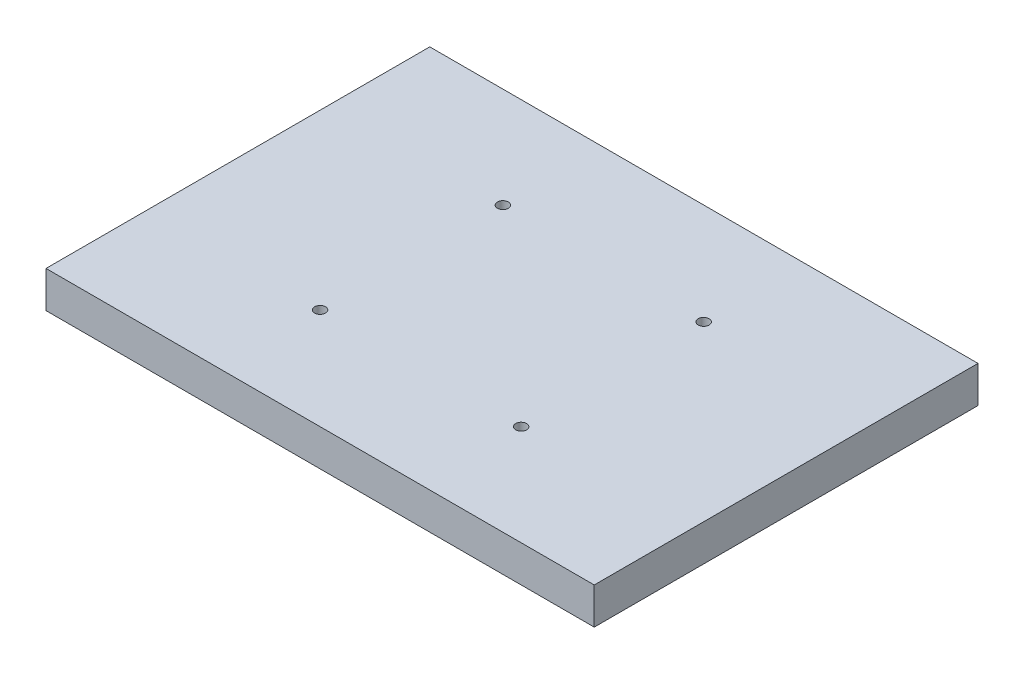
ISO-10303-21;
HEADER;
FILE_DESCRIPTION(('STEP AP214'),'2;1');
FILE_NAME('part.step','',(''),(''),'','','');
FILE_SCHEMA(('AUTOMOTIVE_DESIGN { 1 0 10303 214 1 1 1 1 }'));
ENDSEC;
DATA;
#1=APPLICATION_CONTEXT('core data for automotive mechanical design processes');
#2=APPLICATION_PROTOCOL_DEFINITION('international standard','automotive_design',2000,#1);
#3=PRODUCT_CONTEXT('',#1,'mechanical');
#4=PRODUCT('Part','Part','',(#3));
#5=PRODUCT_RELATED_PRODUCT_CATEGORY('part','',(#4));
#6=PRODUCT_DEFINITION_FORMATION('','',#4);
#7=PRODUCT_DEFINITION_CONTEXT('part definition',#1,'design');
#8=PRODUCT_DEFINITION('design','',#6,#7);
#9=PRODUCT_DEFINITION_SHAPE('','',#8);
#10=(LENGTH_UNIT() NAMED_UNIT(*) SI_UNIT(.MILLI.,.METRE.));
#11=(NAMED_UNIT(*) PLANE_ANGLE_UNIT() SI_UNIT($,.RADIAN.));
#12=(NAMED_UNIT(*) SI_UNIT($,.STERADIAN.) SOLID_ANGLE_UNIT());
#13=UNCERTAINTY_MEASURE_WITH_UNIT(LENGTH_MEASURE(1.E-05),#10,'distance_accuracy_value','');
#14=(GEOMETRIC_REPRESENTATION_CONTEXT(3) GLOBAL_UNCERTAINTY_ASSIGNED_CONTEXT((#13)) GLOBAL_UNIT_ASSIGNED_CONTEXT((#10,
#11,#12)) REPRESENTATION_CONTEXT('',''));
#15=CARTESIAN_POINT('',(0.,0.,0.));
#16=DIRECTION('',(0.,0.,1.));
#17=DIRECTION('',(1.,0.,0.));
#18=AXIS2_PLACEMENT_3D('',#15,#16,#17);
#19=CARTESIAN_POINT('',(150.,-20.,-105.));
#20=DIRECTION('',(1.,0.,0.));
#21=DIRECTION('',(0.,0.,-1.));
#22=AXIS2_PLACEMENT_3D('',#19,#20,#21);
#23=PLANE('',#22);
#24=DIRECTION('',(0.,0.,-1.));
#25=VECTOR('',#24,1.);
#26=CARTESIAN_POINT('',(150.,0.,-105.));
#27=LINE('',#26,#25);
#28=CARTESIAN_POINT('',(150.,0.,105.));
#29=VERTEX_POINT('',#28);
#30=CARTESIAN_POINT('',(150.,0.,-105.));
#31=VERTEX_POINT('',#30);
#32=EDGE_CURVE('E102',#29,#31,#27,.T.);
#33=ORIENTED_EDGE('',*,*,#32,.F.);
#34=DIRECTION('',(0.,1.,0.));
#35=VECTOR('',#34,1.);
#36=CARTESIAN_POINT('',(150.,-20.,105.));
#37=LINE('',#36,#35);
#38=CARTESIAN_POINT('',(150.,-20.,105.));
#39=VERTEX_POINT('',#38);
#40=EDGE_CURVE('E11',#39,#29,#37,.T.);
#41=ORIENTED_EDGE('',*,*,#40,.F.);
#42=DIRECTION('',(0.,0.,-1.));
#43=VECTOR('',#42,1.);
#44=CARTESIAN_POINT('',(150.,-20.,-105.));
#45=LINE('',#44,#43);
#46=CARTESIAN_POINT('',(150.,-20.,-105.));
#47=VERTEX_POINT('',#46);
#48=EDGE_CURVE('E95',#39,#47,#45,.T.);
#49=ORIENTED_EDGE('',*,*,#48,.T.);
#50=DIRECTION('',(0.,1.,0.));
#51=VECTOR('',#50,1.);
#52=CARTESIAN_POINT('',(150.,-20.,-105.));
#53=LINE('',#52,#51);
#54=EDGE_CURVE('E40',#47,#31,#53,.T.);
#55=ORIENTED_EDGE('',*,*,#54,.T.);
#56=EDGE_LOOP('',(#33,#41,#49,#55));
#57=FACE_BOUND('',#56,.T.);
#58=ADVANCED_FACE('F37',(#57),#23,.T.);
#59=CARTESIAN_POINT('',(-150.,-20.,105.));
#60=DIRECTION('',(0.,0.,1.));
#61=DIRECTION('',(1.,0.,0.));
#62=AXIS2_PLACEMENT_3D('',#59,#60,#61);
#63=PLANE('',#62);
#64=DIRECTION('',(1.,0.,0.));
#65=VECTOR('',#64,1.);
#66=CARTESIAN_POINT('',(-150.,0.,105.));
#67=LINE('',#66,#65);
#68=CARTESIAN_POINT('',(-150.,0.,105.));
#69=VERTEX_POINT('',#68);
#70=EDGE_CURVE('E97',#69,#29,#67,.T.);
#71=ORIENTED_EDGE('',*,*,#70,.F.);
#72=DIRECTION('',(0.,1.,0.));
#73=VECTOR('',#72,1.);
#74=CARTESIAN_POINT('',(-150.,-20.,105.));
#75=LINE('',#74,#73);
#76=CARTESIAN_POINT('',(-150.,-20.,105.));
#77=VERTEX_POINT('',#76);
#78=EDGE_CURVE('E46',#77,#69,#75,.T.);
#79=ORIENTED_EDGE('',*,*,#78,.F.);
#80=DIRECTION('',(1.,0.,0.));
#81=VECTOR('',#80,1.);
#82=CARTESIAN_POINT('',(-150.,-20.,105.));
#83=LINE('',#82,#81);
#84=EDGE_CURVE('E92',#77,#39,#83,.T.);
#85=ORIENTED_EDGE('',*,*,#84,.T.);
#86=ORIENTED_EDGE('',*,*,#40,.T.);
#87=EDGE_LOOP('',(#71,#79,#85,#86));
#88=FACE_BOUND('',#87,.T.);
#89=ADVANCED_FACE('F113',(#88),#63,.T.);
#90=CARTESIAN_POINT('',(-150.,-20.,-105.));
#91=DIRECTION('',(-1.,0.,0.));
#92=DIRECTION('',(0.,0.,1.));
#93=AXIS2_PLACEMENT_3D('',#90,#91,#92);
#94=PLANE('',#93);
#95=DIRECTION('',(0.,0.,1.));
#96=VECTOR('',#95,1.);
#97=CARTESIAN_POINT('',(-150.,0.,-105.));
#98=LINE('',#97,#96);
#99=CARTESIAN_POINT('',(-150.,0.,-105.));
#100=VERTEX_POINT('',#99);
#101=EDGE_CURVE('E87',#100,#69,#98,.T.);
#102=ORIENTED_EDGE('',*,*,#101,.F.);
#103=DIRECTION('',(0.,1.,0.));
#104=VECTOR('',#103,1.);
#105=CARTESIAN_POINT('',(-150.,-20.,-105.));
#106=LINE('',#105,#104);
#107=CARTESIAN_POINT('',(-150.,-20.,-105.));
#108=VERTEX_POINT('',#107);
#109=EDGE_CURVE('E82',#108,#100,#106,.T.);
#110=ORIENTED_EDGE('',*,*,#109,.F.);
#111=DIRECTION('',(0.,0.,1.));
#112=VECTOR('',#111,1.);
#113=CARTESIAN_POINT('',(-150.,-20.,-105.));
#114=LINE('',#113,#112);
#115=EDGE_CURVE('E85',#108,#77,#114,.T.);
#116=ORIENTED_EDGE('',*,*,#115,.T.);
#117=ORIENTED_EDGE('',*,*,#78,.T.);
#118=EDGE_LOOP('',(#102,#110,#116,#117));
#119=FACE_BOUND('',#118,.T.);
#120=ADVANCED_FACE('F84',(#119),#94,.T.);
#121=CARTESIAN_POINT('',(-150.,-20.,-105.));
#122=DIRECTION('',(0.,0.,-1.));
#123=DIRECTION('',(-1.,0.,0.));
#124=AXIS2_PLACEMENT_3D('',#121,#122,#123);
#125=PLANE('',#124);
#126=DIRECTION('',(-1.,0.,0.));
#127=VECTOR('',#126,1.);
#128=CARTESIAN_POINT('',(-150.,0.,-105.));
#129=LINE('',#128,#127);
#130=EDGE_CURVE('E105',#31,#100,#129,.T.);
#131=ORIENTED_EDGE('',*,*,#130,.F.);
#132=ORIENTED_EDGE('',*,*,#54,.F.);
#133=DIRECTION('',(-1.,0.,0.));
#134=VECTOR('',#133,1.);
#135=CARTESIAN_POINT('',(-150.,-20.,-105.));
#136=LINE('',#135,#134);
#137=EDGE_CURVE('E91',#47,#108,#136,.T.);
#138=ORIENTED_EDGE('',*,*,#137,.T.);
#139=ORIENTED_EDGE('',*,*,#109,.T.);
#140=EDGE_LOOP('',(#131,#132,#138,#139));
#141=FACE_BOUND('',#140,.T.);
#142=ADVANCED_FACE('F94',(#141),#125,.T.);
#143=CARTESIAN_POINT('',(0.,-20.,0.));
#144=DIRECTION('',(0.,1.,0.));
#145=DIRECTION('',(0.,0.,1.));
#146=AXIS2_PLACEMENT_3D('',#143,#144,#145);
#147=PLANE('',#146);
#148=CARTESIAN_POINT('',(55.2766855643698,-20.,-49.618442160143));
#149=DIRECTION('',(0.,1.,0.));
#150=DIRECTION('',(0.,0.,1.));
#151=AXIS2_PLACEMENT_3D('',#148,#149,#150);
#152=CIRCLE('',#151,3.);
#153=CARTESIAN_POINT('',(55.2766855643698,-20.,-46.618442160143));
#154=VERTEX_POINT('',#153);
#155=EDGE_CURVE('E154',#154,#154,#152,.T.);
#156=ORIENTED_EDGE('',*,*,#155,.T.);
#157=EDGE_LOOP('',(#156));
#158=FACE_BOUND('',#157,.T.);
#159=CARTESIAN_POINT('',(-55.,-20.,-50.));
#160=DIRECTION('',(0.,1.,0.));
#161=DIRECTION('',(0.,0.,1.));
#162=AXIS2_PLACEMENT_3D('',#159,#160,#161);
#163=CIRCLE('',#162,3.);
#164=CARTESIAN_POINT('',(-55.,-20.,-47.));
#165=VERTEX_POINT('',#164);
#166=EDGE_CURVE('E162',#165,#165,#163,.T.);
#167=ORIENTED_EDGE('',*,*,#166,.T.);
#168=EDGE_LOOP('',(#167));
#169=FACE_BOUND('',#168,.T.);
#170=CARTESIAN_POINT('',(55.,-20.,50.));
#171=DIRECTION('',(0.,1.,0.));
#172=DIRECTION('',(0.,0.,1.));
#173=AXIS2_PLACEMENT_3D('',#170,#171,#172);
#174=CIRCLE('',#173,3.);
#175=CARTESIAN_POINT('',(55.,-20.,53.));
#176=VERTEX_POINT('',#175);
#177=EDGE_CURVE('E168',#176,#176,#174,.T.);
#178=ORIENTED_EDGE('',*,*,#177,.T.);
#179=EDGE_LOOP('',(#178));
#180=FACE_BOUND('',#179,.T.);
#181=CARTESIAN_POINT('',(-55.3510049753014,-20.,49.6851540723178));
#182=DIRECTION('',(0.,1.,0.));
#183=DIRECTION('',(0.,0.,1.));
#184=AXIS2_PLACEMENT_3D('',#181,#182,#183);
#185=CIRCLE('',#184,3.);
#186=CARTESIAN_POINT('',(-55.3510049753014,-20.,52.6851540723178));
#187=VERTEX_POINT('',#186);
#188=EDGE_CURVE('E106',#187,#187,#185,.T.);
#189=ORIENTED_EDGE('',*,*,#188,.T.);
#190=EDGE_LOOP('',(#189));
#191=FACE_BOUND('',#190,.T.);
#192=ORIENTED_EDGE('',*,*,#48,.F.);
#193=ORIENTED_EDGE('',*,*,#84,.F.);
#194=ORIENTED_EDGE('',*,*,#115,.F.);
#195=ORIENTED_EDGE('',*,*,#137,.F.);
#196=EDGE_LOOP('',(#192,#193,#194,#195));
#197=FACE_BOUND('',#196,.T.);
#198=ADVANCED_FACE('F90',(#158,#169,#180,#191,#197),#147,.F.);
#199=CARTESIAN_POINT('',(0.,0.,0.));
#200=DIRECTION('',(0.,1.,0.));
#201=DIRECTION('',(0.,0.,1.));
#202=AXIS2_PLACEMENT_3D('',#199,#200,#201);
#203=PLANE('',#202);
#204=CARTESIAN_POINT('',(55.2766855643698,0.,-49.618442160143));
#205=DIRECTION('',(0.,1.,0.));
#206=DIRECTION('',(0.,0.,1.));
#207=AXIS2_PLACEMENT_3D('',#204,#205,#206);
#208=CIRCLE('',#207,3.);
#209=CARTESIAN_POINT('',(55.2766855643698,0.,-46.618442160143));
#210=VERTEX_POINT('',#209);
#211=EDGE_CURVE('E157',#210,#210,#208,.T.);
#212=ORIENTED_EDGE('',*,*,#211,.F.);
#213=EDGE_LOOP('',(#212));
#214=FACE_BOUND('',#213,.T.);
#215=CARTESIAN_POINT('',(-55.,0.,-50.));
#216=DIRECTION('',(0.,1.,0.));
#217=DIRECTION('',(0.,0.,1.));
#218=AXIS2_PLACEMENT_3D('',#215,#216,#217);
#219=CIRCLE('',#218,3.);
#220=CARTESIAN_POINT('',(-55.,0.,-47.));
#221=VERTEX_POINT('',#220);
#222=EDGE_CURVE('E159',#221,#221,#219,.T.);
#223=ORIENTED_EDGE('',*,*,#222,.F.);
#224=EDGE_LOOP('',(#223));
#225=FACE_BOUND('',#224,.T.);
#226=CARTESIAN_POINT('',(55.,0.,50.));
#227=DIRECTION('',(0.,1.,0.));
#228=DIRECTION('',(0.,0.,1.));
#229=AXIS2_PLACEMENT_3D('',#226,#227,#228);
#230=CIRCLE('',#229,3.);
#231=CARTESIAN_POINT('',(55.,0.,53.));
#232=VERTEX_POINT('',#231);
#233=EDGE_CURVE('E165',#232,#232,#230,.T.);
#234=ORIENTED_EDGE('',*,*,#233,.F.);
#235=EDGE_LOOP('',(#234));
#236=FACE_BOUND('',#235,.T.);
#237=CARTESIAN_POINT('',(-55.3510049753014,0.,49.6851540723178));
#238=DIRECTION('',(0.,1.,0.));
#239=DIRECTION('',(0.,0.,1.));
#240=AXIS2_PLACEMENT_3D('',#237,#238,#239);
#241=CIRCLE('',#240,3.);
#242=CARTESIAN_POINT('',(-55.3510049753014,0.,52.6851540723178));
#243=VERTEX_POINT('',#242);
#244=EDGE_CURVE('E171',#243,#243,#241,.T.);
#245=ORIENTED_EDGE('',*,*,#244,.F.);
#246=EDGE_LOOP('',(#245));
#247=FACE_BOUND('',#246,.T.);
#248=ORIENTED_EDGE('',*,*,#32,.T.);
#249=ORIENTED_EDGE('',*,*,#130,.T.);
#250=ORIENTED_EDGE('',*,*,#101,.T.);
#251=ORIENTED_EDGE('',*,*,#70,.T.);
#252=EDGE_LOOP('',(#248,#249,#250,#251));
#253=FACE_BOUND('',#252,.T.);
#254=ADVANCED_FACE('F112',(#214,#225,#236,#247,#253),#203,.T.);
#255=CARTESIAN_POINT('',(-55.3510049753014,-20.,49.6851540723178));
#256=DIRECTION('',(0.,1.,0.));
#257=DIRECTION('',(0.,0.,1.));
#258=AXIS2_PLACEMENT_3D('',#255,#256,#257);
#259=CYLINDRICAL_SURFACE('',#258,3.);
#260=ORIENTED_EDGE('',*,*,#188,.F.);
#261=EDGE_LOOP('',(#260));
#262=FACE_BOUND('',#261,.T.);
#263=ORIENTED_EDGE('',*,*,#244,.T.);
#264=EDGE_LOOP('',(#263));
#265=FACE_BOUND('',#264,.T.);
#266=ADVANCED_FACE('F131',(#262,#265),#259,.F.);
#267=CARTESIAN_POINT('',(55.,-20.,50.));
#268=DIRECTION('',(0.,1.,0.));
#269=DIRECTION('',(0.,0.,1.));
#270=AXIS2_PLACEMENT_3D('',#267,#268,#269);
#271=CYLINDRICAL_SURFACE('',#270,3.);
#272=ORIENTED_EDGE('',*,*,#177,.F.);
#273=EDGE_LOOP('',(#272));
#274=FACE_BOUND('',#273,.T.);
#275=ORIENTED_EDGE('',*,*,#233,.T.);
#276=EDGE_LOOP('',(#275));
#277=FACE_BOUND('',#276,.T.);
#278=ADVANCED_FACE('F138',(#274,#277),#271,.F.);
#279=CARTESIAN_POINT('',(-55.,-20.,-50.));
#280=DIRECTION('',(0.,1.,0.));
#281=DIRECTION('',(0.,0.,1.));
#282=AXIS2_PLACEMENT_3D('',#279,#280,#281);
#283=CYLINDRICAL_SURFACE('',#282,3.);
#284=ORIENTED_EDGE('',*,*,#166,.F.);
#285=EDGE_LOOP('',(#284));
#286=FACE_BOUND('',#285,.T.);
#287=ORIENTED_EDGE('',*,*,#222,.T.);
#288=EDGE_LOOP('',(#287));
#289=FACE_BOUND('',#288,.T.);
#290=ADVANCED_FACE('F142',(#286,#289),#283,.F.);
#291=CARTESIAN_POINT('',(55.2766855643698,-20.,-49.618442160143));
#292=DIRECTION('',(0.,1.,0.));
#293=DIRECTION('',(0.,0.,1.));
#294=AXIS2_PLACEMENT_3D('',#291,#292,#293);
#295=CYLINDRICAL_SURFACE('',#294,3.);
#296=ORIENTED_EDGE('',*,*,#155,.F.);
#297=EDGE_LOOP('',(#296));
#298=FACE_BOUND('',#297,.T.);
#299=ORIENTED_EDGE('',*,*,#211,.T.);
#300=EDGE_LOOP('',(#299));
#301=FACE_BOUND('',#300,.T.);
#302=ADVANCED_FACE('F146',(#298,#301),#295,.F.);
#303=CLOSED_SHELL('',(#58,#89,#120,#142,#198,#254,#266,#278,#290,#302));
#304=MANIFOLD_SOLID_BREP('B2',#303);
#305=ADVANCED_BREP_SHAPE_REPRESENTATION('',(#18,#304),#14);
#306=SHAPE_DEFINITION_REPRESENTATION(#9,#305);
ENDSEC;
END-ISO-10303-21;
